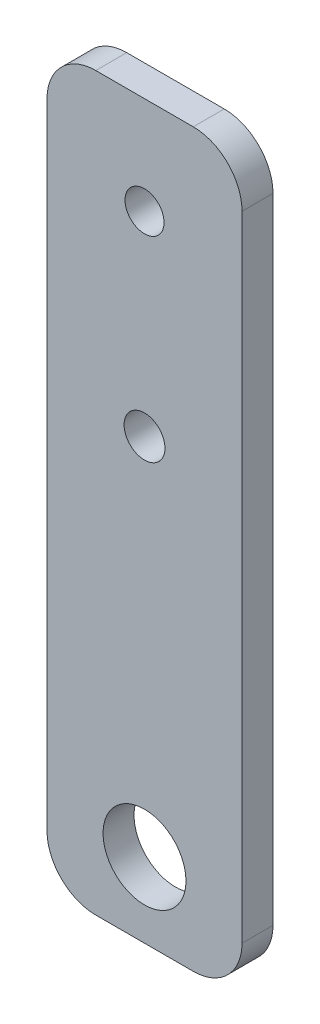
ISO-10303-21;
HEADER;
FILE_DESCRIPTION(('STEP AP214'),'2;1');
FILE_NAME('part.step','',(''),(''),'','','');
FILE_SCHEMA(('AUTOMOTIVE_DESIGN { 1 0 10303 214 1 1 1 1 }'));
ENDSEC;
DATA;
#1=APPLICATION_CONTEXT('core data for automotive mechanical design processes');
#2=APPLICATION_PROTOCOL_DEFINITION('international standard','automotive_design',2000,#1);
#3=PRODUCT_CONTEXT('',#1,'mechanical');
#4=PRODUCT('Part','Part','',(#3));
#5=PRODUCT_RELATED_PRODUCT_CATEGORY('part','',(#4));
#6=PRODUCT_DEFINITION_FORMATION('','',#4);
#7=PRODUCT_DEFINITION_CONTEXT('part definition',#1,'design');
#8=PRODUCT_DEFINITION('design','',#6,#7);
#9=PRODUCT_DEFINITION_SHAPE('','',#8);
#10=(LENGTH_UNIT() NAMED_UNIT(*) SI_UNIT(.MILLI.,.METRE.));
#11=(NAMED_UNIT(*) PLANE_ANGLE_UNIT() SI_UNIT($,.RADIAN.));
#12=(NAMED_UNIT(*) SI_UNIT($,.STERADIAN.) SOLID_ANGLE_UNIT());
#13=UNCERTAINTY_MEASURE_WITH_UNIT(LENGTH_MEASURE(1.E-05),#10,'distance_accuracy_value','');
#14=(GEOMETRIC_REPRESENTATION_CONTEXT(3) GLOBAL_UNCERTAINTY_ASSIGNED_CONTEXT((#13)) GLOBAL_UNIT_ASSIGNED_CONTEXT((#10,
#11,#12)) REPRESENTATION_CONTEXT('',''));
#15=CARTESIAN_POINT('',(0.,0.,0.));
#16=DIRECTION('',(0.,0.,1.));
#17=DIRECTION('',(1.,0.,0.));
#18=AXIS2_PLACEMENT_3D('',#15,#16,#17);
#19=CARTESIAN_POINT('',(-9.99999999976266,0.,3.175));
#20=DIRECTION('',(-1.,0.,0.));
#21=DIRECTION('',(0.,-1.,0.));
#22=AXIS2_PLACEMENT_3D('',#19,#20,#21);
#23=PLANE('',#22);
#24=DIRECTION('',(0.,1.,0.));
#25=VECTOR('',#24,1.);
#26=CARTESIAN_POINT('',(-9.99999999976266,0.,3.175));
#27=LINE('',#26,#25);
#28=CARTESIAN_POINT('',(-9.99999999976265,-50.,3.175));
#29=VERTEX_POINT('',#28);
#30=CARTESIAN_POINT('',(-9.99999999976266,15.,3.175));
#31=VERTEX_POINT('',#30);
#32=EDGE_CURVE('E171',#29,#31,#27,.T.);
#33=ORIENTED_EDGE('',*,*,#32,.T.);
#34=DIRECTION('',(0.,0.,-1.));
#35=VECTOR('',#34,1.);
#36=CARTESIAN_POINT('',(-9.99999999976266,15.,0.));
#37=LINE('',#36,#35);
#38=CARTESIAN_POINT('',(-9.99999999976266,15.,0.));
#39=VERTEX_POINT('',#38);
#40=EDGE_CURVE('E127',#31,#39,#37,.T.);
#41=ORIENTED_EDGE('',*,*,#40,.T.);
#42=DIRECTION('',(0.,1.,0.));
#43=VECTOR('',#42,1.);
#44=CARTESIAN_POINT('',(-9.99999999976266,0.,0.));
#45=LINE('',#44,#43);
#46=CARTESIAN_POINT('',(-9.99999999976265,-50.,0.));
#47=VERTEX_POINT('',#46);
#48=EDGE_CURVE('E112',#47,#39,#45,.T.);
#49=ORIENTED_EDGE('',*,*,#48,.F.);
#50=DIRECTION('',(0.,0.,-1.));
#51=VECTOR('',#50,1.);
#52=CARTESIAN_POINT('',(-9.99999999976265,-50.,3.175));
#53=LINE('',#52,#51);
#54=EDGE_CURVE('E124',#47,#29,#53,.F.);
#55=ORIENTED_EDGE('',*,*,#54,.T.);
#56=EDGE_LOOP('',(#33,#41,#49,#55));
#57=FACE_BOUND('',#56,.T.);
#58=ADVANCED_FACE('F41',(#57),#23,.T.);
#59=CARTESIAN_POINT('',(0.,-55.,3.175));
#60=DIRECTION('',(0.,-1.,0.));
#61=DIRECTION('',(0.,0.,-1.));
#62=AXIS2_PLACEMENT_3D('',#59,#60,#61);
#63=PLANE('',#62);
#64=DIRECTION('',(-1.,0.,0.));
#65=VECTOR('',#64,1.);
#66=CARTESIAN_POINT('',(0.,-55.,3.175));
#67=LINE('',#66,#65);
#68=CARTESIAN_POINT('',(5.00000000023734,-55.,3.175));
#69=VERTEX_POINT('',#68);
#70=CARTESIAN_POINT('',(-4.99999999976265,-55.,3.175));
#71=VERTEX_POINT('',#70);
#72=EDGE_CURVE('E165',#69,#71,#67,.T.);
#73=ORIENTED_EDGE('',*,*,#72,.T.);
#74=DIRECTION('',(0.,0.,-1.));
#75=VECTOR('',#74,1.);
#76=CARTESIAN_POINT('',(-4.99999999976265,-55.,3.175));
#77=LINE('',#76,#75);
#78=CARTESIAN_POINT('',(-4.99999999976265,-55.,0.));
#79=VERTEX_POINT('',#78);
#80=EDGE_CURVE('E11',#71,#79,#77,.T.);
#81=ORIENTED_EDGE('',*,*,#80,.T.);
#82=DIRECTION('',(-1.,0.,0.));
#83=VECTOR('',#82,1.);
#84=CARTESIAN_POINT('',(0.,-55.,0.));
#85=LINE('',#84,#83);
#86=CARTESIAN_POINT('',(5.00000000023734,-55.,0.));
#87=VERTEX_POINT('',#86);
#88=EDGE_CURVE('E114',#87,#79,#85,.T.);
#89=ORIENTED_EDGE('',*,*,#88,.F.);
#90=DIRECTION('',(0.,0.,-1.));
#91=VECTOR('',#90,1.);
#92=CARTESIAN_POINT('',(5.00000000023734,-55.,3.175));
#93=LINE('',#92,#91);
#94=EDGE_CURVE('E49',#87,#69,#93,.F.);
#95=ORIENTED_EDGE('',*,*,#94,.T.);
#96=EDGE_LOOP('',(#73,#81,#89,#95));
#97=FACE_BOUND('',#96,.T.);
#98=ADVANCED_FACE('F164',(#97),#63,.T.);
#99=CARTESIAN_POINT('',(10.0000000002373,0.,3.175));
#100=DIRECTION('',(-1.,0.,0.));
#101=DIRECTION('',(0.,0.,1.));
#102=AXIS2_PLACEMENT_3D('',#99,#100,#101);
#103=PLANE('',#102);
#104=DIRECTION('',(0.,1.,0.));
#105=VECTOR('',#104,1.);
#106=CARTESIAN_POINT('',(10.0000000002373,0.,0.));
#107=LINE('',#106,#105);
#108=CARTESIAN_POINT('',(10.0000000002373,-50.,0.));
#109=VERTEX_POINT('',#108);
#110=CARTESIAN_POINT('',(10.0000000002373,15.,0.));
#111=VERTEX_POINT('',#110);
#112=EDGE_CURVE('E176',#109,#111,#107,.T.);
#113=ORIENTED_EDGE('',*,*,#112,.T.);
#114=DIRECTION('',(0.,0.,-1.));
#115=VECTOR('',#114,1.);
#116=CARTESIAN_POINT('',(10.0000000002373,15.,3.175));
#117=LINE('',#116,#115);
#118=CARTESIAN_POINT('',(10.0000000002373,15.,3.175));
#119=VERTEX_POINT('',#118);
#120=EDGE_CURVE('E56',#111,#119,#117,.F.);
#121=ORIENTED_EDGE('',*,*,#120,.T.);
#122=DIRECTION('',(0.,1.,0.));
#123=VECTOR('',#122,1.);
#124=CARTESIAN_POINT('',(10.0000000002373,0.,3.175));
#125=LINE('',#124,#123);
#126=CARTESIAN_POINT('',(10.0000000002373,-50.,3.175));
#127=VERTEX_POINT('',#126);
#128=EDGE_CURVE('E170',#127,#119,#125,.T.);
#129=ORIENTED_EDGE('',*,*,#128,.F.);
#130=DIRECTION('',(0.,0.,-1.));
#131=VECTOR('',#130,1.);
#132=CARTESIAN_POINT('',(10.0000000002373,-50.,0.));
#133=LINE('',#132,#131);
#134=EDGE_CURVE('E158',#127,#109,#133,.T.);
#135=ORIENTED_EDGE('',*,*,#134,.T.);
#136=EDGE_LOOP('',(#113,#121,#129,#135));
#137=FACE_BOUND('',#136,.T.);
#138=ADVANCED_FACE('F175',(#137),#103,.F.);
#139=CARTESIAN_POINT('',(2.37340410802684E-10,-10.,3.175));
#140=DIRECTION('',(0.,0.,-1.));
#141=DIRECTION('',(-1.,0.,0.));
#142=AXIS2_PLACEMENT_3D('',#139,#140,#141);
#143=CYLINDRICAL_SURFACE('',#142,2.09499999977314);
#144=CARTESIAN_POINT('',(2.37340410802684E-10,-10.,3.175));
#145=DIRECTION('',(0.,0.,1.));
#146=DIRECTION('',(1.,0.,0.));
#147=AXIS2_PLACEMENT_3D('',#144,#145,#146);
#148=CIRCLE('',#147,2.09499999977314);
#149=CARTESIAN_POINT('',(2.09500000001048,-10.,3.175));
#150=VERTEX_POINT('',#149);
#151=EDGE_CURVE('E137',#150,#150,#148,.T.);
#152=ORIENTED_EDGE('',*,*,#151,.T.);
#153=EDGE_LOOP('',(#152));
#154=FACE_BOUND('',#153,.T.);
#155=CARTESIAN_POINT('',(2.37340410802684E-10,-10.,0.));
#156=DIRECTION('',(0.,0.,1.));
#157=DIRECTION('',(1.,0.,0.));
#158=AXIS2_PLACEMENT_3D('',#155,#156,#157);
#159=CIRCLE('',#158,2.09499999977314);
#160=CARTESIAN_POINT('',(2.09500000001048,-10.,0.));
#161=VERTEX_POINT('',#160);
#162=EDGE_CURVE('E181',#161,#161,#159,.T.);
#163=ORIENTED_EDGE('',*,*,#162,.F.);
#164=EDGE_LOOP('',(#163));
#165=FACE_BOUND('',#164,.T.);
#166=ADVANCED_FACE('F217',(#154,#165),#143,.F.);
#167=CARTESIAN_POINT('',(0.,20.,3.175));
#168=DIRECTION('',(0.,-1.,0.));
#169=DIRECTION('',(1.,0.,0.));
#170=AXIS2_PLACEMENT_3D('',#167,#168,#169);
#171=PLANE('',#170);
#172=DIRECTION('',(-1.,0.,0.));
#173=VECTOR('',#172,1.);
#174=CARTESIAN_POINT('',(0.,20.,0.));
#175=LINE('',#174,#173);
#176=CARTESIAN_POINT('',(5.00000000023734,20.,0.));
#177=VERTEX_POINT('',#176);
#178=CARTESIAN_POINT('',(-4.99999999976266,20.,0.));
#179=VERTEX_POINT('',#178);
#180=EDGE_CURVE('E178',#177,#179,#175,.T.);
#181=ORIENTED_EDGE('',*,*,#180,.T.);
#182=DIRECTION('',(0.,0.,-1.));
#183=VECTOR('',#182,1.);
#184=CARTESIAN_POINT('',(-4.99999999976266,20.,3.175));
#185=LINE('',#184,#183);
#186=CARTESIAN_POINT('',(-4.99999999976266,20.,3.175));
#187=VERTEX_POINT('',#186);
#188=EDGE_CURVE('E150',#179,#187,#185,.F.);
#189=ORIENTED_EDGE('',*,*,#188,.T.);
#190=DIRECTION('',(-1.,0.,0.));
#191=VECTOR('',#190,1.);
#192=CARTESIAN_POINT('',(0.,20.,3.175));
#193=LINE('',#192,#191);
#194=CARTESIAN_POINT('',(5.00000000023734,20.,3.175));
#195=VERTEX_POINT('',#194);
#196=EDGE_CURVE('E197',#195,#187,#193,.T.);
#197=ORIENTED_EDGE('',*,*,#196,.F.);
#198=DIRECTION('',(0.,0.,-1.));
#199=VECTOR('',#198,1.);
#200=CARTESIAN_POINT('',(5.00000000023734,20.,3.175));
#201=LINE('',#200,#199);
#202=EDGE_CURVE('E147',#195,#177,#201,.T.);
#203=ORIENTED_EDGE('',*,*,#202,.T.);
#204=EDGE_LOOP('',(#181,#189,#197,#203));
#205=FACE_BOUND('',#204,.T.);
#206=ADVANCED_FACE('F208',(#205),#171,.F.);
#207=CARTESIAN_POINT('',(2.37339661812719E-10,9.99999999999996,3.175));
#208=DIRECTION('',(0.,0.,-1.));
#209=DIRECTION('',(-1.,0.,0.));
#210=AXIS2_PLACEMENT_3D('',#207,#208,#209);
#211=CYLINDRICAL_SURFACE('',#210,1.99999999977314);
#212=CARTESIAN_POINT('',(2.37339661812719E-10,9.99999999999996,3.175));
#213=DIRECTION('',(0.,0.,1.));
#214=DIRECTION('',(1.,0.,0.));
#215=AXIS2_PLACEMENT_3D('',#212,#213,#214);
#216=CIRCLE('',#215,1.99999999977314);
#217=CARTESIAN_POINT('',(2.00000000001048,9.99999999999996,3.175));
#218=VERTEX_POINT('',#217);
#219=EDGE_CURVE('E187',#218,#218,#216,.T.);
#220=ORIENTED_EDGE('',*,*,#219,.T.);
#221=EDGE_LOOP('',(#220));
#222=FACE_BOUND('',#221,.T.);
#223=CARTESIAN_POINT('',(2.37339661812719E-10,9.99999999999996,0.));
#224=DIRECTION('',(0.,0.,1.));
#225=DIRECTION('',(1.,0.,0.));
#226=AXIS2_PLACEMENT_3D('',#223,#224,#225);
#227=CIRCLE('',#226,1.99999999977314);
#228=CARTESIAN_POINT('',(2.00000000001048,9.99999999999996,0.));
#229=VERTEX_POINT('',#228);
#230=EDGE_CURVE('E128',#229,#229,#227,.T.);
#231=ORIENTED_EDGE('',*,*,#230,.F.);
#232=EDGE_LOOP('',(#231));
#233=FACE_BOUND('',#232,.T.);
#234=ADVANCED_FACE('F205',(#222,#233),#211,.F.);
#235=CARTESIAN_POINT('',(2.34250119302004E-10,-47.35,3.175));
#236=DIRECTION('',(0.,0.,-1.));
#237=DIRECTION('',(-1.,0.,0.));
#238=AXIS2_PLACEMENT_3D('',#235,#236,#237);
#239=CYLINDRICAL_SURFACE('',#238,4.24999999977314);
#240=CARTESIAN_POINT('',(2.34250119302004E-10,-47.35,3.175));
#241=DIRECTION('',(0.,0.,1.));
#242=DIRECTION('',(1.,0.,0.));
#243=AXIS2_PLACEMENT_3D('',#240,#241,#242);
#244=CIRCLE('',#243,4.24999999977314);
#245=CARTESIAN_POINT('',(4.25000000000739,-47.35,3.175));
#246=VERTEX_POINT('',#245);
#247=EDGE_CURVE('E133',#246,#246,#244,.T.);
#248=ORIENTED_EDGE('',*,*,#247,.T.);
#249=EDGE_LOOP('',(#248));
#250=FACE_BOUND('',#249,.T.);
#251=CARTESIAN_POINT('',(2.34250119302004E-10,-47.35,0.));
#252=DIRECTION('',(0.,0.,1.));
#253=DIRECTION('',(1.,0.,0.));
#254=AXIS2_PLACEMENT_3D('',#251,#252,#253);
#255=CIRCLE('',#254,4.24999999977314);
#256=CARTESIAN_POINT('',(4.25000000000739,-47.35,0.));
#257=VERTEX_POINT('',#256);
#258=EDGE_CURVE('E140',#257,#257,#255,.T.);
#259=ORIENTED_EDGE('',*,*,#258,.F.);
#260=EDGE_LOOP('',(#259));
#261=FACE_BOUND('',#260,.T.);
#262=ADVANCED_FACE('F207',(#250,#261),#239,.F.);
#263=CARTESIAN_POINT('',(0.,0.,3.175));
#264=DIRECTION('',(0.,0.,1.));
#265=DIRECTION('',(1.,0.,0.));
#266=AXIS2_PLACEMENT_3D('',#263,#264,#265);
#267=PLANE('',#266);
#268=ORIENTED_EDGE('',*,*,#219,.F.);
#269=EDGE_LOOP('',(#268));
#270=FACE_BOUND('',#269,.T.);
#271=ORIENTED_EDGE('',*,*,#196,.T.);
#272=CARTESIAN_POINT('',(-4.99999999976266,15.,3.175));
#273=DIRECTION('',(0.,0.,1.));
#274=DIRECTION('',(1.,0.,0.));
#275=AXIS2_PLACEMENT_3D('',#272,#273,#274);
#276=CIRCLE('',#275,5.);
#277=EDGE_CURVE('E156',#187,#31,#276,.T.);
#278=ORIENTED_EDGE('',*,*,#277,.T.);
#279=ORIENTED_EDGE('',*,*,#32,.F.);
#280=CARTESIAN_POINT('',(-4.99999999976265,-50.,3.175));
#281=DIRECTION('',(0.,0.,1.));
#282=DIRECTION('',(1.,0.,0.));
#283=AXIS2_PLACEMENT_3D('',#280,#281,#282);
#284=CIRCLE('',#283,5.);
#285=EDGE_CURVE('E132',#29,#71,#284,.T.);
#286=ORIENTED_EDGE('',*,*,#285,.T.);
#287=ORIENTED_EDGE('',*,*,#72,.F.);
#288=CARTESIAN_POINT('',(5.00000000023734,-50.,3.175));
#289=DIRECTION('',(0.,0.,1.));
#290=DIRECTION('',(1.,0.,0.));
#291=AXIS2_PLACEMENT_3D('',#288,#289,#290);
#292=CIRCLE('',#291,5.);
#293=EDGE_CURVE('E63',#69,#127,#292,.T.);
#294=ORIENTED_EDGE('',*,*,#293,.T.);
#295=ORIENTED_EDGE('',*,*,#128,.T.);
#296=CARTESIAN_POINT('',(5.00000000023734,15.,3.175));
#297=DIRECTION('',(0.,0.,1.));
#298=DIRECTION('',(1.,0.,0.));
#299=AXIS2_PLACEMENT_3D('',#296,#297,#298);
#300=CIRCLE('',#299,5.);
#301=EDGE_CURVE('E154',#119,#195,#300,.T.);
#302=ORIENTED_EDGE('',*,*,#301,.T.);
#303=EDGE_LOOP('',(#271,#278,#279,#286,#287,#294,#295,#302));
#304=FACE_BOUND('',#303,.T.);
#305=ORIENTED_EDGE('',*,*,#151,.F.);
#306=EDGE_LOOP('',(#305));
#307=FACE_BOUND('',#306,.T.);
#308=ORIENTED_EDGE('',*,*,#247,.F.);
#309=EDGE_LOOP('',(#308));
#310=FACE_BOUND('',#309,.T.);
#311=ADVANCED_FACE('F168',(#270,#304,#307,#310),#267,.T.);
#312=CARTESIAN_POINT('',(0.,0.,0.));
#313=DIRECTION('',(0.,0.,1.));
#314=DIRECTION('',(1.,0.,0.));
#315=AXIS2_PLACEMENT_3D('',#312,#313,#314);
#316=PLANE('',#315);
#317=ORIENTED_EDGE('',*,*,#230,.T.);
#318=EDGE_LOOP('',(#317));
#319=FACE_BOUND('',#318,.T.);
#320=ORIENTED_EDGE('',*,*,#48,.T.);
#321=CARTESIAN_POINT('',(-4.99999999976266,15.,0.));
#322=DIRECTION('',(0.,0.,1.));
#323=DIRECTION('',(1.,0.,0.));
#324=AXIS2_PLACEMENT_3D('',#321,#322,#323);
#325=CIRCLE('',#324,5.);
#326=EDGE_CURVE('E145',#39,#179,#325,.F.);
#327=ORIENTED_EDGE('',*,*,#326,.T.);
#328=ORIENTED_EDGE('',*,*,#180,.F.);
#329=CARTESIAN_POINT('',(5.00000000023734,15.,0.));
#330=DIRECTION('',(0.,0.,1.));
#331=DIRECTION('',(1.,0.,0.));
#332=AXIS2_PLACEMENT_3D('',#329,#330,#331);
#333=CIRCLE('',#332,5.);
#334=EDGE_CURVE('E118',#177,#111,#333,.F.);
#335=ORIENTED_EDGE('',*,*,#334,.T.);
#336=ORIENTED_EDGE('',*,*,#112,.F.);
#337=CARTESIAN_POINT('',(5.00000000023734,-50.,0.));
#338=DIRECTION('',(0.,0.,1.));
#339=DIRECTION('',(1.,0.,0.));
#340=AXIS2_PLACEMENT_3D('',#337,#338,#339);
#341=CIRCLE('',#340,5.);
#342=EDGE_CURVE('E119',#109,#87,#341,.F.);
#343=ORIENTED_EDGE('',*,*,#342,.T.);
#344=ORIENTED_EDGE('',*,*,#88,.T.);
#345=CARTESIAN_POINT('',(-4.99999999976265,-50.,0.));
#346=DIRECTION('',(0.,0.,1.));
#347=DIRECTION('',(1.,0.,0.));
#348=AXIS2_PLACEMENT_3D('',#345,#346,#347);
#349=CIRCLE('',#348,5.);
#350=EDGE_CURVE('E108',#79,#47,#349,.F.);
#351=ORIENTED_EDGE('',*,*,#350,.T.);
#352=EDGE_LOOP('',(#320,#327,#328,#335,#336,#343,#344,#351));
#353=FACE_BOUND('',#352,.T.);
#354=ORIENTED_EDGE('',*,*,#162,.T.);
#355=EDGE_LOOP('',(#354));
#356=FACE_BOUND('',#355,.T.);
#357=ORIENTED_EDGE('',*,*,#258,.T.);
#358=EDGE_LOOP('',(#357));
#359=FACE_BOUND('',#358,.T.);
#360=ADVANCED_FACE('F110',(#319,#353,#356,#359),#316,.F.);
#361=CARTESIAN_POINT('',(-4.99999999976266,15.,3.175));
#362=DIRECTION('',(0.,0.,1.));
#363=DIRECTION('',(1.,0.,0.));
#364=AXIS2_PLACEMENT_3D('',#361,#362,#363);
#365=CYLINDRICAL_SURFACE('',#364,5.);
#366=ORIENTED_EDGE('',*,*,#277,.F.);
#367=ORIENTED_EDGE('',*,*,#188,.F.);
#368=ORIENTED_EDGE('',*,*,#326,.F.);
#369=ORIENTED_EDGE('',*,*,#40,.F.);
#370=EDGE_LOOP('',(#366,#367,#368,#369));
#371=FACE_BOUND('',#370,.T.);
#372=ADVANCED_FACE('F234',(#371),#365,.T.);
#373=CARTESIAN_POINT('',(5.00000000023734,15.,3.175));
#374=DIRECTION('',(0.,0.,-1.));
#375=DIRECTION('',(-1.,0.,0.));
#376=AXIS2_PLACEMENT_3D('',#373,#374,#375);
#377=CYLINDRICAL_SURFACE('',#376,5.);
#378=ORIENTED_EDGE('',*,*,#301,.F.);
#379=ORIENTED_EDGE('',*,*,#120,.F.);
#380=ORIENTED_EDGE('',*,*,#334,.F.);
#381=ORIENTED_EDGE('',*,*,#202,.F.);
#382=EDGE_LOOP('',(#378,#379,#380,#381));
#383=FACE_BOUND('',#382,.T.);
#384=ADVANCED_FACE('F254',(#383),#377,.T.);
#385=CARTESIAN_POINT('',(-4.99999999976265,-50.,3.175));
#386=DIRECTION('',(0.,0.,-1.));
#387=DIRECTION('',(-1.,0.,0.));
#388=AXIS2_PLACEMENT_3D('',#385,#386,#387);
#389=CYLINDRICAL_SURFACE('',#388,5.);
#390=ORIENTED_EDGE('',*,*,#285,.F.);
#391=ORIENTED_EDGE('',*,*,#54,.F.);
#392=ORIENTED_EDGE('',*,*,#350,.F.);
#393=ORIENTED_EDGE('',*,*,#80,.F.);
#394=EDGE_LOOP('',(#390,#391,#392,#393));
#395=FACE_BOUND('',#394,.T.);
#396=ADVANCED_FACE('F131',(#395),#389,.T.);
#397=CARTESIAN_POINT('',(5.00000000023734,-50.,3.175));
#398=DIRECTION('',(0.,0.,1.));
#399=DIRECTION('',(1.,0.,0.));
#400=AXIS2_PLACEMENT_3D('',#397,#398,#399);
#401=CYLINDRICAL_SURFACE('',#400,5.);
#402=ORIENTED_EDGE('',*,*,#293,.F.);
#403=ORIENTED_EDGE('',*,*,#94,.F.);
#404=ORIENTED_EDGE('',*,*,#342,.F.);
#405=ORIENTED_EDGE('',*,*,#134,.F.);
#406=EDGE_LOOP('',(#402,#403,#404,#405));
#407=FACE_BOUND('',#406,.T.);
#408=ADVANCED_FACE('F43',(#407),#401,.T.);
#409=CLOSED_SHELL('',(#58,#98,#138,#166,#206,#234,#262,#311,#360,#372,#384,#396,#408));
#410=MANIFOLD_SOLID_BREP('B2',#409);
#411=ADVANCED_BREP_SHAPE_REPRESENTATION('',(#18,#410),#14);
#412=SHAPE_DEFINITION_REPRESENTATION(#9,#411);
ENDSEC;
END-ISO-10303-21;
